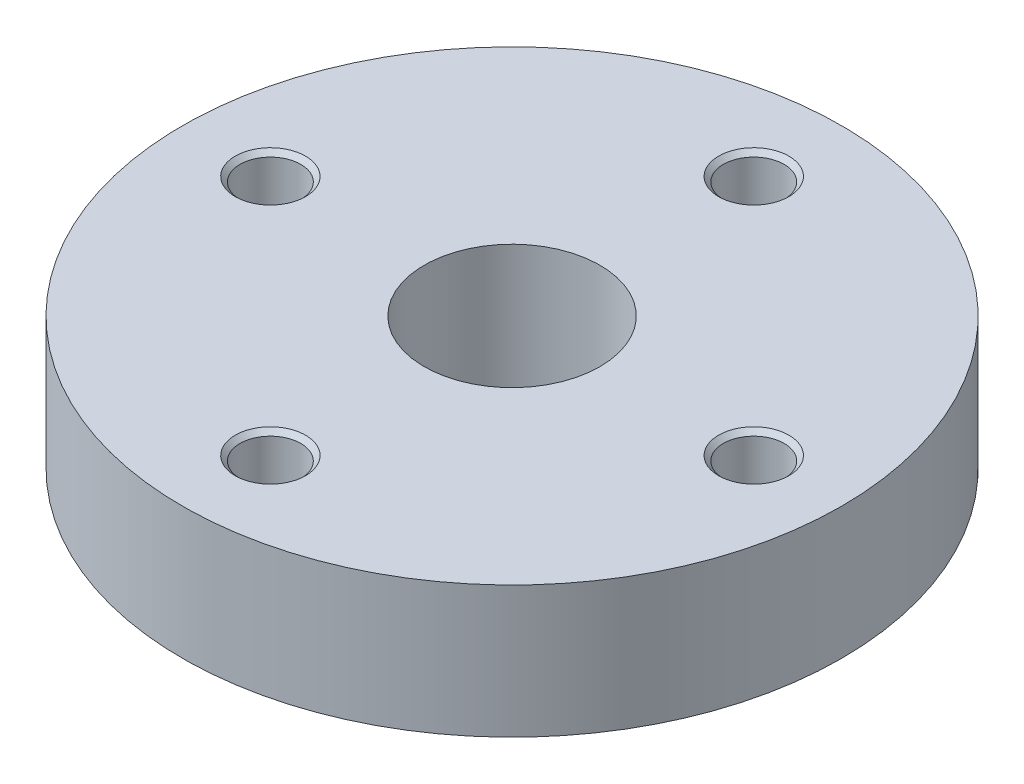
ISO-10303-21;
HEADER;
FILE_DESCRIPTION(('STEP AP214'),'2;1');
FILE_NAME('part.step','',(''),(''),'','','');
FILE_SCHEMA(('AUTOMOTIVE_DESIGN { 1 0 10303 214 1 1 1 1 }'));
ENDSEC;
DATA;
#1=APPLICATION_CONTEXT('core data for automotive mechanical design processes');
#2=APPLICATION_PROTOCOL_DEFINITION('international standard','automotive_design',2000,#1);
#3=PRODUCT_CONTEXT('',#1,'mechanical');
#4=PRODUCT('Part','Part','',(#3));
#5=PRODUCT_RELATED_PRODUCT_CATEGORY('part','',(#4));
#6=PRODUCT_DEFINITION_FORMATION('','',#4);
#7=PRODUCT_DEFINITION_CONTEXT('part definition',#1,'design');
#8=PRODUCT_DEFINITION('design','',#6,#7);
#9=PRODUCT_DEFINITION_SHAPE('','',#8);
#10=(LENGTH_UNIT() NAMED_UNIT(*) SI_UNIT(.MILLI.,.METRE.));
#11=(NAMED_UNIT(*) PLANE_ANGLE_UNIT() SI_UNIT($,.RADIAN.));
#12=(NAMED_UNIT(*) SI_UNIT($,.STERADIAN.) SOLID_ANGLE_UNIT());
#13=UNCERTAINTY_MEASURE_WITH_UNIT(LENGTH_MEASURE(1.E-05),#10,'distance_accuracy_value','');
#14=(GEOMETRIC_REPRESENTATION_CONTEXT(3) GLOBAL_UNCERTAINTY_ASSIGNED_CONTEXT((#13)) GLOBAL_UNIT_ASSIGNED_CONTEXT((#10,
#11,#12)) REPRESENTATION_CONTEXT('',''));
#15=CARTESIAN_POINT('',(0.,0.,0.));
#16=DIRECTION('',(0.,0.,1.));
#17=DIRECTION('',(1.,0.,0.));
#18=AXIS2_PLACEMENT_3D('',#15,#16,#17);
#19=CARTESIAN_POINT('',(0.,15.,0.));
#20=DIRECTION('',(0.,-1.,0.));
#21=DIRECTION('',(1.,0.,0.));
#22=AXIS2_PLACEMENT_3D('',#19,#20,#21);
#23=CYLINDRICAL_SURFACE('',#22,75.);
#24=CARTESIAN_POINT('',(0.,0.,0.));
#25=DIRECTION('',(0.,1.,0.));
#26=DIRECTION('',(1.,0.,0.));
#27=AXIS2_PLACEMENT_3D('',#24,#25,#26);
#28=CIRCLE('',#27,75.);
#29=CARTESIAN_POINT('',(75.,0.,0.));
#30=VERTEX_POINT('',#29);
#31=EDGE_CURVE('E9',#30,#30,#28,.T.);
#32=ORIENTED_EDGE('',*,*,#31,.T.);
#33=EDGE_LOOP('',(#32));
#34=FACE_BOUND('',#33,.T.);
#35=CARTESIAN_POINT('',(0.,30.,0.));
#36=DIRECTION('',(0.,1.,0.));
#37=DIRECTION('',(1.,0.,0.));
#38=AXIS2_PLACEMENT_3D('',#35,#36,#37);
#39=CIRCLE('',#38,75.);
#40=CARTESIAN_POINT('',(75.,30.,0.));
#41=VERTEX_POINT('',#40);
#42=EDGE_CURVE('E175',#41,#41,#39,.T.);
#43=ORIENTED_EDGE('',*,*,#42,.F.);
#44=EDGE_LOOP('',(#43));
#45=FACE_BOUND('',#44,.T.);
#46=ADVANCED_FACE('F15',(#34,#45),#23,.T.);
#47=CARTESIAN_POINT('',(47.5,0.,0.));
#48=DIRECTION('',(0.,-1.,0.));
#49=DIRECTION('',(-1.,0.,0.));
#50=AXIS2_PLACEMENT_3D('',#47,#48,#49);
#51=PLANE('',#50);
#52=CARTESIAN_POINT('',(0.,0.,0.));
#53=DIRECTION('',(0.,1.,0.));
#54=DIRECTION('',(1.,0.,0.));
#55=AXIS2_PLACEMENT_3D('',#52,#53,#54);
#56=CIRCLE('',#55,20.);
#57=CARTESIAN_POINT('',(20.,0.,0.));
#58=VERTEX_POINT('',#57);
#59=EDGE_CURVE('E22',#58,#58,#56,.T.);
#60=ORIENTED_EDGE('',*,*,#59,.T.);
#61=EDGE_LOOP('',(#60));
#62=FACE_BOUND('',#61,.T.);
#63=ORIENTED_EDGE('',*,*,#31,.F.);
#64=EDGE_LOOP('',(#63));
#65=FACE_BOUND('',#64,.T.);
#66=ADVANCED_FACE('F181',(#62,#65),#51,.T.);
#67=CARTESIAN_POINT('',(0.,15.,0.));
#68=DIRECTION('',(0.,-1.,0.));
#69=DIRECTION('',(1.,0.,0.));
#70=AXIS2_PLACEMENT_3D('',#67,#68,#69);
#71=CYLINDRICAL_SURFACE('',#70,20.);
#72=CARTESIAN_POINT('',(0.,30.,0.));
#73=DIRECTION('',(0.,1.,0.));
#74=DIRECTION('',(1.,0.,0.));
#75=AXIS2_PLACEMENT_3D('',#72,#73,#74);
#76=CIRCLE('',#75,20.);
#77=CARTESIAN_POINT('',(20.,30.,0.));
#78=VERTEX_POINT('',#77);
#79=EDGE_CURVE('E173',#78,#78,#76,.T.);
#80=ORIENTED_EDGE('',*,*,#79,.T.);
#81=EDGE_LOOP('',(#80));
#82=FACE_BOUND('',#81,.T.);
#83=ORIENTED_EDGE('',*,*,#59,.F.);
#84=EDGE_LOOP('',(#83));
#85=FACE_BOUND('',#84,.T.);
#86=ADVANCED_FACE('F186',(#82,#85),#71,.F.);
#87=CARTESIAN_POINT('',(47.5,30.,0.));
#88=DIRECTION('',(0.,1.,0.));
#89=DIRECTION('',(1.,0.,0.));
#90=AXIS2_PLACEMENT_3D('',#87,#88,#89);
#91=PLANE('',#90);
#92=ORIENTED_EDGE('',*,*,#42,.T.);
#93=EDGE_LOOP('',(#92));
#94=FACE_BOUND('',#93,.T.);
#95=ORIENTED_EDGE('',*,*,#79,.F.);
#96=EDGE_LOOP('',(#95));
#97=FACE_BOUND('',#96,.T.);
#98=CARTESIAN_POINT('',(55.,30.,0.));
#99=DIRECTION('',(0.,-1.,0.));
#100=DIRECTION('',(1.,0.,0.));
#101=AXIS2_PLACEMENT_3D('',#98,#99,#100);
#102=CIRCLE('',#101,8.);
#103=CARTESIAN_POINT('',(63.,30.,0.));
#104=VERTEX_POINT('',#103);
#105=EDGE_CURVE('E141',#104,#104,#102,.T.);
#106=ORIENTED_EDGE('',*,*,#105,.T.);
#107=EDGE_LOOP('',(#106));
#108=FACE_BOUND('',#107,.T.);
#109=CARTESIAN_POINT('',(0.,30.,-55.));
#110=DIRECTION('',(0.,-1.,0.));
#111=DIRECTION('',(0.,0.,-1.));
#112=AXIS2_PLACEMENT_3D('',#109,#110,#111);
#113=CIRCLE('',#112,8.);
#114=CARTESIAN_POINT('',(0.,30.,-63.));
#115=VERTEX_POINT('',#114);
#116=EDGE_CURVE('E154',#115,#115,#113,.T.);
#117=ORIENTED_EDGE('',*,*,#116,.T.);
#118=EDGE_LOOP('',(#117));
#119=FACE_BOUND('',#118,.T.);
#120=CARTESIAN_POINT('',(-55.,30.,0.));
#121=DIRECTION('',(0.,-1.,0.));
#122=DIRECTION('',(-1.,0.,0.));
#123=AXIS2_PLACEMENT_3D('',#120,#121,#122);
#124=CIRCLE('',#123,8.);
#125=CARTESIAN_POINT('',(-63.,30.,0.));
#126=VERTEX_POINT('',#125);
#127=EDGE_CURVE('E121',#126,#126,#124,.T.);
#128=ORIENTED_EDGE('',*,*,#127,.T.);
#129=EDGE_LOOP('',(#128));
#130=FACE_BOUND('',#129,.T.);
#131=CARTESIAN_POINT('',(0.,30.,55.));
#132=DIRECTION('',(0.,-1.,0.));
#133=DIRECTION('',(0.,0.,1.));
#134=AXIS2_PLACEMENT_3D('',#131,#132,#133);
#135=CIRCLE('',#134,8.);
#136=CARTESIAN_POINT('',(0.,30.,63.));
#137=VERTEX_POINT('',#136);
#138=EDGE_CURVE('E137',#137,#137,#135,.T.);
#139=ORIENTED_EDGE('',*,*,#138,.T.);
#140=EDGE_LOOP('',(#139));
#141=FACE_BOUND('',#140,.T.);
#142=ADVANCED_FACE('F122',(#94,#97,#108,#119,#130,#141),#91,.T.);
#143=CARTESIAN_POINT('',(55.,5.00308975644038,0.));
#144=DIRECTION('',(0.,1.,0.));
#145=DIRECTION('',(1.,0.,0.));
#146=AXIS2_PLACEMENT_3D('',#143,#144,#145);
#147=CONICAL_SURFACE('',#146,3.45875,1.0471975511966);
#148=CARTESIAN_POINT('',(55.,7.,0.));
#149=DIRECTION('',(0.,-1.,0.));
#150=DIRECTION('',(1.,0.,0.));
#151=AXIS2_PLACEMENT_3D('',#148,#149,#150);
#152=CIRCLE('',#151,6.9175);
#153=CARTESIAN_POINT('',(61.9175,7.,0.));
#154=VERTEX_POINT('',#153);
#155=EDGE_CURVE('E171',#154,#154,#152,.T.);
#156=ORIENTED_EDGE('',*,*,#155,.F.);
#157=EDGE_LOOP('',(#156));
#158=FACE_BOUND('',#157,.T.);
#159=CARTESIAN_POINT('',(55.,3.00617951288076,0.));
#160=VERTEX_POINT('',#159);
#161=VERTEX_LOOP('',#160);
#162=FACE_BOUND('',#161,.T.);
#163=ADVANCED_FACE('F196',(#158,#162),#147,.F.);
#164=CARTESIAN_POINT('',(55.,9.95875,0.));
#165=DIRECTION('',(0.,1.,0.));
#166=DIRECTION('',(1.,0.,0.));
#167=AXIS2_PLACEMENT_3D('',#164,#165,#166);
#168=CYLINDRICAL_SURFACE('',#167,6.9175);
#169=CARTESIAN_POINT('',(55.,12.9175,0.));
#170=DIRECTION('',(0.,-1.,0.));
#171=DIRECTION('',(1.,0.,0.));
#172=AXIS2_PLACEMENT_3D('',#169,#170,#171);
#173=CIRCLE('',#172,6.9175);
#174=CARTESIAN_POINT('',(61.9175,12.9175,0.));
#175=VERTEX_POINT('',#174);
#176=EDGE_CURVE('E147',#175,#175,#173,.T.);
#177=ORIENTED_EDGE('',*,*,#176,.F.);
#178=EDGE_LOOP('',(#177));
#179=FACE_BOUND('',#178,.T.);
#180=ORIENTED_EDGE('',*,*,#155,.T.);
#181=EDGE_LOOP('',(#180));
#182=FACE_BOUND('',#181,.T.);
#183=ADVANCED_FACE('F199',(#179,#182),#168,.F.);
#184=CARTESIAN_POINT('',(55.,13.45875,0.));
#185=DIRECTION('',(0.,1.,0.));
#186=DIRECTION('',(1.,0.,0.));
#187=AXIS2_PLACEMENT_3D('',#184,#185,#186);
#188=CONICAL_SURFACE('',#187,7.45875,0.785398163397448);
#189=CARTESIAN_POINT('',(55.,14.,0.));
#190=DIRECTION('',(0.,-1.,0.));
#191=DIRECTION('',(1.,0.,0.));
#192=AXIS2_PLACEMENT_3D('',#189,#190,#191);
#193=CIRCLE('',#192,8.);
#194=CARTESIAN_POINT('',(63.,14.,0.));
#195=VERTEX_POINT('',#194);
#196=EDGE_CURVE('E140',#195,#195,#193,.T.);
#197=ORIENTED_EDGE('',*,*,#196,.F.);
#198=EDGE_LOOP('',(#197));
#199=FACE_BOUND('',#198,.T.);
#200=ORIENTED_EDGE('',*,*,#176,.T.);
#201=EDGE_LOOP('',(#200));
#202=FACE_BOUND('',#201,.T.);
#203=ADVANCED_FACE('F201',(#199,#202),#188,.F.);
#204=CARTESIAN_POINT('',(62.45875,14.,0.));
#205=DIRECTION('',(0.,1.,0.));
#206=DIRECTION('',(-1.,0.,0.));
#207=AXIS2_PLACEMENT_3D('',#204,#205,#206);
#208=PLANE('',#207);
#209=CARTESIAN_POINT('',(55.,14.,0.));
#210=DIRECTION('',(0.,-1.,0.));
#211=DIRECTION('',(1.,0.,0.));
#212=AXIS2_PLACEMENT_3D('',#209,#210,#211);
#213=CIRCLE('',#212,6.9175);
#214=CARTESIAN_POINT('',(61.9175,14.,0.));
#215=VERTEX_POINT('',#214);
#216=EDGE_CURVE('E138',#215,#215,#213,.T.);
#217=ORIENTED_EDGE('',*,*,#216,.F.);
#218=EDGE_LOOP('',(#217));
#219=FACE_BOUND('',#218,.T.);
#220=ORIENTED_EDGE('',*,*,#196,.T.);
#221=EDGE_LOOP('',(#220));
#222=FACE_BOUND('',#221,.T.);
#223=ADVANCED_FACE('F204',(#219,#222),#208,.F.);
#224=CARTESIAN_POINT('',(55.,21.45875,0.));
#225=DIRECTION('',(0.,1.,0.));
#226=DIRECTION('',(1.,0.,0.));
#227=AXIS2_PLACEMENT_3D('',#224,#225,#226);
#228=CYLINDRICAL_SURFACE('',#227,6.9175);
#229=CARTESIAN_POINT('',(55.,28.9175,0.));
#230=DIRECTION('',(0.,-1.,0.));
#231=DIRECTION('',(1.,0.,0.));
#232=AXIS2_PLACEMENT_3D('',#229,#230,#231);
#233=CIRCLE('',#232,6.9175);
#234=CARTESIAN_POINT('',(61.9175,28.9175,0.));
#235=VERTEX_POINT('',#234);
#236=EDGE_CURVE('E167',#235,#235,#233,.T.);
#237=ORIENTED_EDGE('',*,*,#236,.F.);
#238=EDGE_LOOP('',(#237));
#239=FACE_BOUND('',#238,.T.);
#240=ORIENTED_EDGE('',*,*,#216,.T.);
#241=EDGE_LOOP('',(#240));
#242=FACE_BOUND('',#241,.T.);
#243=ADVANCED_FACE('F208',(#239,#242),#228,.F.);
#244=CARTESIAN_POINT('',(55.,29.45875,0.));
#245=DIRECTION('',(0.,1.,0.));
#246=DIRECTION('',(1.,0.,0.));
#247=AXIS2_PLACEMENT_3D('',#244,#245,#246);
#248=CONICAL_SURFACE('',#247,7.45875,0.785398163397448);
#249=ORIENTED_EDGE('',*,*,#105,.F.);
#250=EDGE_LOOP('',(#249));
#251=FACE_BOUND('',#250,.T.);
#252=ORIENTED_EDGE('',*,*,#236,.T.);
#253=EDGE_LOOP('',(#252));
#254=FACE_BOUND('',#253,.T.);
#255=ADVANCED_FACE('F212',(#251,#254),#248,.F.);
#256=CARTESIAN_POINT('',(0.,5.00308975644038,-55.));
#257=DIRECTION('',(0.,1.,0.));
#258=DIRECTION('',(0.,0.,-1.));
#259=AXIS2_PLACEMENT_3D('',#256,#257,#258);
#260=CONICAL_SURFACE('',#259,3.45875,1.0471975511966);
#261=CARTESIAN_POINT('',(0.,7.,-55.));
#262=DIRECTION('',(0.,-1.,0.));
#263=DIRECTION('',(0.,0.,-1.));
#264=AXIS2_PLACEMENT_3D('',#261,#262,#263);
#265=CIRCLE('',#264,6.9175);
#266=CARTESIAN_POINT('',(0.,7.,-61.9175));
#267=VERTEX_POINT('',#266);
#268=EDGE_CURVE('E165',#267,#267,#265,.T.);
#269=ORIENTED_EDGE('',*,*,#268,.F.);
#270=EDGE_LOOP('',(#269));
#271=FACE_BOUND('',#270,.T.);
#272=CARTESIAN_POINT('',(0.,3.00617951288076,-55.));
#273=VERTEX_POINT('',#272);
#274=VERTEX_LOOP('',#273);
#275=FACE_BOUND('',#274,.T.);
#276=ADVANCED_FACE('F216',(#271,#275),#260,.F.);
#277=CARTESIAN_POINT('',(0.,9.95875,-55.));
#278=DIRECTION('',(0.,1.,0.));
#279=DIRECTION('',(0.,0.,-1.));
#280=AXIS2_PLACEMENT_3D('',#277,#278,#279);
#281=CYLINDRICAL_SURFACE('',#280,6.9175);
#282=CARTESIAN_POINT('',(0.,12.9175,-55.));
#283=DIRECTION('',(0.,-1.,0.));
#284=DIRECTION('',(0.,0.,-1.));
#285=AXIS2_PLACEMENT_3D('',#282,#283,#284);
#286=CIRCLE('',#285,6.9175);
#287=CARTESIAN_POINT('',(0.,12.9175,-61.9175));
#288=VERTEX_POINT('',#287);
#289=EDGE_CURVE('E163',#288,#288,#286,.T.);
#290=ORIENTED_EDGE('',*,*,#289,.F.);
#291=EDGE_LOOP('',(#290));
#292=FACE_BOUND('',#291,.T.);
#293=ORIENTED_EDGE('',*,*,#268,.T.);
#294=EDGE_LOOP('',(#293));
#295=FACE_BOUND('',#294,.T.);
#296=ADVANCED_FACE('F220',(#292,#295),#281,.F.);
#297=CARTESIAN_POINT('',(0.,13.45875,-55.));
#298=DIRECTION('',(0.,1.,0.));
#299=DIRECTION('',(0.,0.,-1.));
#300=AXIS2_PLACEMENT_3D('',#297,#298,#299);
#301=CONICAL_SURFACE('',#300,7.45875,0.785398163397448);
#302=CARTESIAN_POINT('',(0.,14.,-55.));
#303=DIRECTION('',(0.,-1.,0.));
#304=DIRECTION('',(0.,0.,-1.));
#305=AXIS2_PLACEMENT_3D('',#302,#303,#304);
#306=CIRCLE('',#305,8.);
#307=CARTESIAN_POINT('',(0.,14.,-63.));
#308=VERTEX_POINT('',#307);
#309=EDGE_CURVE('E161',#308,#308,#306,.T.);
#310=ORIENTED_EDGE('',*,*,#309,.F.);
#311=EDGE_LOOP('',(#310));
#312=FACE_BOUND('',#311,.T.);
#313=ORIENTED_EDGE('',*,*,#289,.T.);
#314=EDGE_LOOP('',(#313));
#315=FACE_BOUND('',#314,.T.);
#316=ADVANCED_FACE('F224',(#312,#315),#301,.F.);
#317=CARTESIAN_POINT('',(0.,14.,-62.45875));
#318=DIRECTION('',(0.,1.,0.));
#319=DIRECTION('',(0.,0.,1.));
#320=AXIS2_PLACEMENT_3D('',#317,#318,#319);
#321=PLANE('',#320);
#322=CARTESIAN_POINT('',(0.,14.,-55.));
#323=DIRECTION('',(0.,-1.,0.));
#324=DIRECTION('',(0.,0.,-1.));
#325=AXIS2_PLACEMENT_3D('',#322,#323,#324);
#326=CIRCLE('',#325,6.9175);
#327=CARTESIAN_POINT('',(0.,14.,-61.9175));
#328=VERTEX_POINT('',#327);
#329=EDGE_CURVE('E156',#328,#328,#326,.T.);
#330=ORIENTED_EDGE('',*,*,#329,.F.);
#331=EDGE_LOOP('',(#330));
#332=FACE_BOUND('',#331,.T.);
#333=ORIENTED_EDGE('',*,*,#309,.T.);
#334=EDGE_LOOP('',(#333));
#335=FACE_BOUND('',#334,.T.);
#336=ADVANCED_FACE('F228',(#332,#335),#321,.F.);
#337=CARTESIAN_POINT('',(0.,21.45875,-55.));
#338=DIRECTION('',(0.,1.,0.));
#339=DIRECTION('',(0.,0.,-1.));
#340=AXIS2_PLACEMENT_3D('',#337,#338,#339);
#341=CYLINDRICAL_SURFACE('',#340,6.9175);
#342=CARTESIAN_POINT('',(0.,28.9175,-55.));
#343=DIRECTION('',(0.,-1.,0.));
#344=DIRECTION('',(0.,0.,-1.));
#345=AXIS2_PLACEMENT_3D('',#342,#343,#344);
#346=CIRCLE('',#345,6.9175);
#347=CARTESIAN_POINT('',(0.,28.9175,-61.9175));
#348=VERTEX_POINT('',#347);
#349=EDGE_CURVE('E157',#348,#348,#346,.T.);
#350=ORIENTED_EDGE('',*,*,#349,.F.);
#351=EDGE_LOOP('',(#350));
#352=FACE_BOUND('',#351,.T.);
#353=ORIENTED_EDGE('',*,*,#329,.T.);
#354=EDGE_LOOP('',(#353));
#355=FACE_BOUND('',#354,.T.);
#356=ADVANCED_FACE('F232',(#352,#355),#341,.F.);
#357=CARTESIAN_POINT('',(0.,29.45875,-55.));
#358=DIRECTION('',(0.,1.,0.));
#359=DIRECTION('',(0.,0.,-1.));
#360=AXIS2_PLACEMENT_3D('',#357,#358,#359);
#361=CONICAL_SURFACE('',#360,7.45875,0.785398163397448);
#362=ORIENTED_EDGE('',*,*,#116,.F.);
#363=EDGE_LOOP('',(#362));
#364=FACE_BOUND('',#363,.T.);
#365=ORIENTED_EDGE('',*,*,#349,.T.);
#366=EDGE_LOOP('',(#365));
#367=FACE_BOUND('',#366,.T.);
#368=ADVANCED_FACE('F234',(#364,#367),#361,.F.);
#369=CARTESIAN_POINT('',(-55.,5.00308975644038,0.));
#370=DIRECTION('',(0.,1.,0.));
#371=DIRECTION('',(-1.,0.,0.));
#372=AXIS2_PLACEMENT_3D('',#369,#370,#371);
#373=CONICAL_SURFACE('',#372,3.45875,1.0471975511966);
#374=CARTESIAN_POINT('',(-55.,7.,0.));
#375=DIRECTION('',(0.,-1.,0.));
#376=DIRECTION('',(-1.,0.,0.));
#377=AXIS2_PLACEMENT_3D('',#374,#375,#376);
#378=CIRCLE('',#377,6.9175);
#379=CARTESIAN_POINT('',(-61.9175,7.,0.));
#380=VERTEX_POINT('',#379);
#381=EDGE_CURVE('E152',#380,#380,#378,.T.);
#382=ORIENTED_EDGE('',*,*,#381,.F.);
#383=EDGE_LOOP('',(#382));
#384=FACE_BOUND('',#383,.T.);
#385=CARTESIAN_POINT('',(-55.,3.00617951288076,0.));
#386=VERTEX_POINT('',#385);
#387=VERTEX_LOOP('',#386);
#388=FACE_BOUND('',#387,.T.);
#389=ADVANCED_FACE('F237',(#384,#388),#373,.F.);
#390=CARTESIAN_POINT('',(-55.,9.95875,0.));
#391=DIRECTION('',(0.,1.,0.));
#392=DIRECTION('',(-1.,0.,0.));
#393=AXIS2_PLACEMENT_3D('',#390,#391,#392);
#394=CYLINDRICAL_SURFACE('',#393,6.9175);
#395=CARTESIAN_POINT('',(-55.,12.9175,0.));
#396=DIRECTION('',(0.,-1.,0.));
#397=DIRECTION('',(-1.,0.,0.));
#398=AXIS2_PLACEMENT_3D('',#395,#396,#397);
#399=CIRCLE('',#398,6.9175);
#400=CARTESIAN_POINT('',(-61.9175,12.9175,0.));
#401=VERTEX_POINT('',#400);
#402=EDGE_CURVE('E150',#401,#401,#399,.T.);
#403=ORIENTED_EDGE('',*,*,#402,.F.);
#404=EDGE_LOOP('',(#403));
#405=FACE_BOUND('',#404,.T.);
#406=ORIENTED_EDGE('',*,*,#381,.T.);
#407=EDGE_LOOP('',(#406));
#408=FACE_BOUND('',#407,.T.);
#409=ADVANCED_FACE('F241',(#405,#408),#394,.F.);
#410=CARTESIAN_POINT('',(-55.,13.45875,0.));
#411=DIRECTION('',(0.,1.,0.));
#412=DIRECTION('',(-1.,0.,0.));
#413=AXIS2_PLACEMENT_3D('',#410,#411,#412);
#414=CONICAL_SURFACE('',#413,7.45875,0.785398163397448);
#415=CARTESIAN_POINT('',(-55.,14.,0.));
#416=DIRECTION('',(0.,-1.,0.));
#417=DIRECTION('',(-1.,0.,0.));
#418=AXIS2_PLACEMENT_3D('',#415,#416,#417);
#419=CIRCLE('',#418,8.);
#420=CARTESIAN_POINT('',(-63.,14.,0.));
#421=VERTEX_POINT('',#420);
#422=EDGE_CURVE('E128',#421,#421,#419,.T.);
#423=ORIENTED_EDGE('',*,*,#422,.F.);
#424=EDGE_LOOP('',(#423));
#425=FACE_BOUND('',#424,.T.);
#426=ORIENTED_EDGE('',*,*,#402,.T.);
#427=EDGE_LOOP('',(#426));
#428=FACE_BOUND('',#427,.T.);
#429=ADVANCED_FACE('F245',(#425,#428),#414,.F.);
#430=CARTESIAN_POINT('',(-62.45875,14.,0.));
#431=DIRECTION('',(0.,1.,0.));
#432=DIRECTION('',(1.,0.,0.));
#433=AXIS2_PLACEMENT_3D('',#430,#431,#432);
#434=PLANE('',#433);
#435=CARTESIAN_POINT('',(-55.,14.,0.));
#436=DIRECTION('',(0.,-1.,0.));
#437=DIRECTION('',(-1.,0.,0.));
#438=AXIS2_PLACEMENT_3D('',#435,#436,#437);
#439=CIRCLE('',#438,6.9175);
#440=CARTESIAN_POINT('',(-61.9175,14.,0.));
#441=VERTEX_POINT('',#440);
#442=EDGE_CURVE('E125',#441,#441,#439,.T.);
#443=ORIENTED_EDGE('',*,*,#442,.F.);
#444=EDGE_LOOP('',(#443));
#445=FACE_BOUND('',#444,.T.);
#446=ORIENTED_EDGE('',*,*,#422,.T.);
#447=EDGE_LOOP('',(#446));
#448=FACE_BOUND('',#447,.T.);
#449=ADVANCED_FACE('F247',(#445,#448),#434,.F.);
#450=CARTESIAN_POINT('',(-55.,21.45875,0.));
#451=DIRECTION('',(0.,1.,0.));
#452=DIRECTION('',(-1.,0.,0.));
#453=AXIS2_PLACEMENT_3D('',#450,#451,#452);
#454=CYLINDRICAL_SURFACE('',#453,6.9175);
#455=CARTESIAN_POINT('',(-55.,28.9175,0.));
#456=DIRECTION('',(0.,-1.,0.));
#457=DIRECTION('',(-1.,0.,0.));
#458=AXIS2_PLACEMENT_3D('',#455,#456,#457);
#459=CIRCLE('',#458,6.9175);
#460=CARTESIAN_POINT('',(-61.9175,28.9175,0.));
#461=VERTEX_POINT('',#460);
#462=EDGE_CURVE('E126',#461,#461,#459,.T.);
#463=ORIENTED_EDGE('',*,*,#462,.F.);
#464=EDGE_LOOP('',(#463));
#465=FACE_BOUND('',#464,.T.);
#466=ORIENTED_EDGE('',*,*,#442,.T.);
#467=EDGE_LOOP('',(#466));
#468=FACE_BOUND('',#467,.T.);
#469=ADVANCED_FACE('F250',(#465,#468),#454,.F.);
#470=CARTESIAN_POINT('',(-55.,29.45875,0.));
#471=DIRECTION('',(0.,1.,0.));
#472=DIRECTION('',(-1.,0.,0.));
#473=AXIS2_PLACEMENT_3D('',#470,#471,#472);
#474=CONICAL_SURFACE('',#473,7.45875,0.785398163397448);
#475=ORIENTED_EDGE('',*,*,#127,.F.);
#476=EDGE_LOOP('',(#475));
#477=FACE_BOUND('',#476,.T.);
#478=ORIENTED_EDGE('',*,*,#462,.T.);
#479=EDGE_LOOP('',(#478));
#480=FACE_BOUND('',#479,.T.);
#481=ADVANCED_FACE('F254',(#477,#480),#474,.F.);
#482=CARTESIAN_POINT('',(0.,5.00308975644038,55.));
#483=DIRECTION('',(0.,1.,0.));
#484=DIRECTION('',(0.,0.,1.));
#485=AXIS2_PLACEMENT_3D('',#482,#483,#484);
#486=CONICAL_SURFACE('',#485,3.45875,1.0471975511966);
#487=CARTESIAN_POINT('',(0.,7.,55.));
#488=DIRECTION('',(0.,-1.,0.));
#489=DIRECTION('',(0.,0.,1.));
#490=AXIS2_PLACEMENT_3D('',#487,#488,#489);
#491=CIRCLE('',#490,6.9175);
#492=CARTESIAN_POINT('',(0.,7.,61.9175));
#493=VERTEX_POINT('',#492);
#494=EDGE_CURVE('E130',#493,#493,#491,.T.);
#495=ORIENTED_EDGE('',*,*,#494,.F.);
#496=EDGE_LOOP('',(#495));
#497=FACE_BOUND('',#496,.T.);
#498=CARTESIAN_POINT('',(0.,3.00617951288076,55.));
#499=VERTEX_POINT('',#498);
#500=VERTEX_LOOP('',#499);
#501=FACE_BOUND('',#500,.T.);
#502=ADVANCED_FACE('F256',(#497,#501),#486,.F.);
#503=CARTESIAN_POINT('',(0.,9.95875,55.));
#504=DIRECTION('',(0.,1.,0.));
#505=DIRECTION('',(0.,0.,1.));
#506=AXIS2_PLACEMENT_3D('',#503,#504,#505);
#507=CYLINDRICAL_SURFACE('',#506,6.9175);
#508=CARTESIAN_POINT('',(0.,12.9175,55.));
#509=DIRECTION('',(0.,-1.,0.));
#510=DIRECTION('',(0.,0.,1.));
#511=AXIS2_PLACEMENT_3D('',#508,#509,#510);
#512=CIRCLE('',#511,6.9175);
#513=CARTESIAN_POINT('',(0.,12.9175,61.9175));
#514=VERTEX_POINT('',#513);
#515=EDGE_CURVE('E134',#514,#514,#512,.T.);
#516=ORIENTED_EDGE('',*,*,#515,.F.);
#517=EDGE_LOOP('',(#516));
#518=FACE_BOUND('',#517,.T.);
#519=ORIENTED_EDGE('',*,*,#494,.T.);
#520=EDGE_LOOP('',(#519));
#521=FACE_BOUND('',#520,.T.);
#522=ADVANCED_FACE('F259',(#518,#521),#507,.F.);
#523=CARTESIAN_POINT('',(0.,13.45875,55.));
#524=DIRECTION('',(0.,1.,0.));
#525=DIRECTION('',(0.,0.,1.));
#526=AXIS2_PLACEMENT_3D('',#523,#524,#525);
#527=CONICAL_SURFACE('',#526,7.45875,0.785398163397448);
#528=CARTESIAN_POINT('',(0.,14.,55.));
#529=DIRECTION('',(0.,-1.,0.));
#530=DIRECTION('',(0.,0.,1.));
#531=AXIS2_PLACEMENT_3D('',#528,#529,#530);
#532=CIRCLE('',#531,8.);
#533=CARTESIAN_POINT('',(0.,14.,63.));
#534=VERTEX_POINT('',#533);
#535=EDGE_CURVE('E145',#534,#534,#532,.T.);
#536=ORIENTED_EDGE('',*,*,#535,.F.);
#537=EDGE_LOOP('',(#536));
#538=FACE_BOUND('',#537,.T.);
#539=ORIENTED_EDGE('',*,*,#515,.T.);
#540=EDGE_LOOP('',(#539));
#541=FACE_BOUND('',#540,.T.);
#542=ADVANCED_FACE('F261',(#538,#541),#527,.F.);
#543=CARTESIAN_POINT('',(0.,14.,62.45875));
#544=DIRECTION('',(0.,1.,0.));
#545=DIRECTION('',(0.,0.,-1.));
#546=AXIS2_PLACEMENT_3D('',#543,#544,#545);
#547=PLANE('',#546);
#548=CARTESIAN_POINT('',(0.,14.,55.));
#549=DIRECTION('',(0.,-1.,0.));
#550=DIRECTION('',(0.,0.,1.));
#551=AXIS2_PLACEMENT_3D('',#548,#549,#550);
#552=CIRCLE('',#551,6.9175);
#553=CARTESIAN_POINT('',(0.,14.,61.9175));
#554=VERTEX_POINT('',#553);
#555=EDGE_CURVE('E142',#554,#554,#552,.T.);
#556=ORIENTED_EDGE('',*,*,#555,.F.);
#557=EDGE_LOOP('',(#556));
#558=FACE_BOUND('',#557,.T.);
#559=ORIENTED_EDGE('',*,*,#535,.T.);
#560=EDGE_LOOP('',(#559));
#561=FACE_BOUND('',#560,.T.);
#562=ADVANCED_FACE('F264',(#558,#561),#547,.F.);
#563=CARTESIAN_POINT('',(0.,21.45875,55.));
#564=DIRECTION('',(0.,1.,0.));
#565=DIRECTION('',(0.,0.,1.));
#566=AXIS2_PLACEMENT_3D('',#563,#564,#565);
#567=CYLINDRICAL_SURFACE('',#566,6.9175);
#568=CARTESIAN_POINT('',(0.,28.9175,55.));
#569=DIRECTION('',(0.,-1.,0.));
#570=DIRECTION('',(0.,0.,1.));
#571=AXIS2_PLACEMENT_3D('',#568,#569,#570);
#572=CIRCLE('',#571,6.9175);
#573=CARTESIAN_POINT('',(0.,28.9175,61.9175));
#574=VERTEX_POINT('',#573);
#575=EDGE_CURVE('E135',#574,#574,#572,.T.);
#576=ORIENTED_EDGE('',*,*,#575,.F.);
#577=EDGE_LOOP('',(#576));
#578=FACE_BOUND('',#577,.T.);
#579=ORIENTED_EDGE('',*,*,#555,.T.);
#580=EDGE_LOOP('',(#579));
#581=FACE_BOUND('',#580,.T.);
#582=ADVANCED_FACE('F268',(#578,#581),#567,.F.);
#583=CARTESIAN_POINT('',(0.,29.45875,55.));
#584=DIRECTION('',(0.,1.,0.));
#585=DIRECTION('',(0.,0.,1.));
#586=AXIS2_PLACEMENT_3D('',#583,#584,#585);
#587=CONICAL_SURFACE('',#586,7.45875,0.785398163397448);
#588=ORIENTED_EDGE('',*,*,#138,.F.);
#589=EDGE_LOOP('',(#588));
#590=FACE_BOUND('',#589,.T.);
#591=ORIENTED_EDGE('',*,*,#575,.T.);
#592=EDGE_LOOP('',(#591));
#593=FACE_BOUND('',#592,.T.);
#594=ADVANCED_FACE('F278',(#590,#593),#587,.F.);
#595=CLOSED_SHELL('',(#46,#66,#86,#142,#163,#183,#203,#223,#243,#255,#276,#296,#316,#336,#356,
#368,#389,#409,#429,#449,#469,#481,#502,#522,#542,#562,#582,#594));
#596=MANIFOLD_SOLID_BREP('B1',#595);
#597=ADVANCED_BREP_SHAPE_REPRESENTATION('',(#18,#596),#14);
#598=SHAPE_DEFINITION_REPRESENTATION(#9,#597);
ENDSEC;
END-ISO-10303-21;
